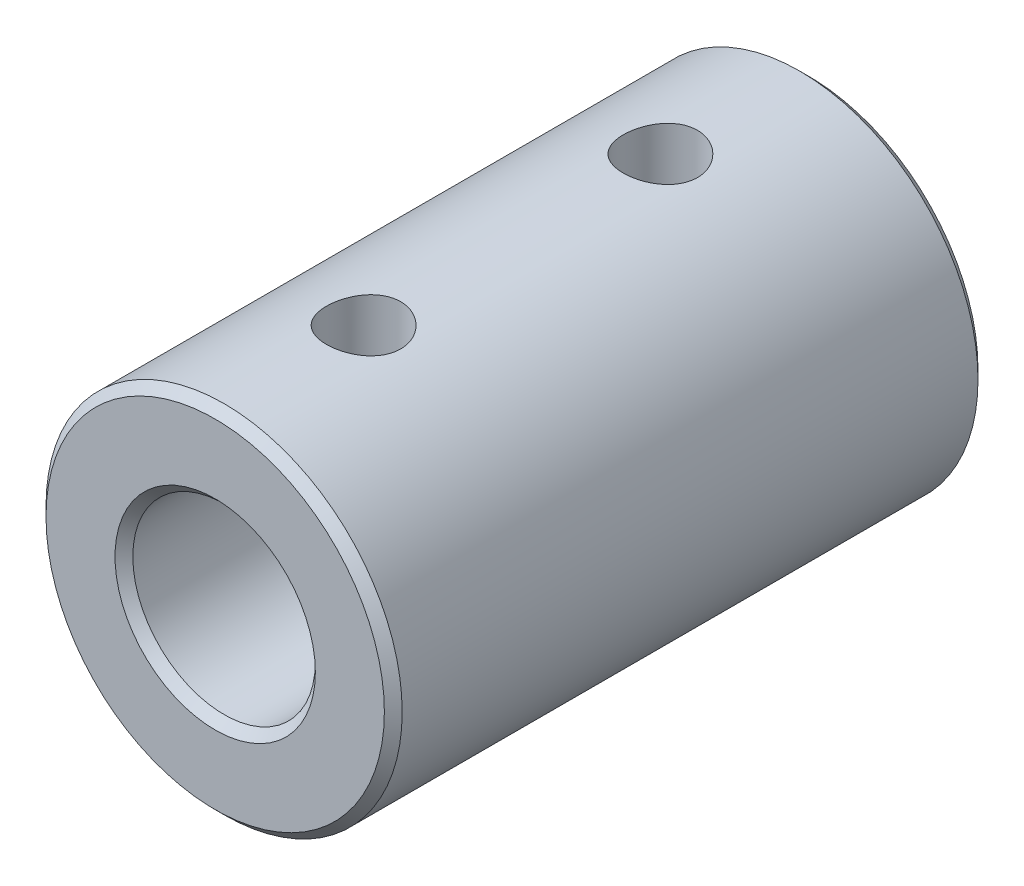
from build123d import *

# Parameters (mm, degrees)
ESQUISSE1_R             = 6
ESQUISSE1_R_2           = 2.575
BOSS_EXTRU_1_DEPTH      = 10
ESQUISSE2_R             = 3.075
ENL_V_MAT_EXTRU_1_DEPTH = 10
ESQUISSE3_R             = 1.25
ENL_V_MAT_EXTRU_2_DEPTH = 6
CHANFREIN1_SIZE         = 0.3


with BuildPart() as part:
    # Esquisse1 → Boss.-Extru.1 (new, symmetric)
    with BuildSketch(Plane.XY):
        Circle(ESQUISSE1_R)
        Circle(ESQUISSE1_R_2, mode=Mode.SUBTRACT)
    extrude(amount=BOSS_EXTRU_1_DEPTH, both=True)

    # Esquisse2 → Enl_v. mat.-Extru.1 (cut)
    with BuildSketch(Plane.XY.offset(10)):
        Circle(ESQUISSE2_R)
    extrude(amount=-ENL_V_MAT_EXTRU_1_DEPTH, mode=Mode.SUBTRACT)

    # Esquisse3 → Enl_v. mat.-Extru.2 (cut, symmetric)
    with BuildSketch(Plane(origin=(0, 0, 0), x_dir=(-1, 0, 0), z_dir=(0, 1, 0))):
        with Locations(Location((0, 5, 0), (0, 0, 90))):
            Circle(ESQUISSE3_R)
        with Locations(Location((0, -5, 0), (0, 0, 90))):
            Circle(ESQUISSE3_R)
    extrude(amount=ENL_V_MAT_EXTRU_2_DEPTH, both=True, mode=Mode.SUBTRACT)

    # Chanfrein1
    chanfrein1_edges = [part.edges().sort_by_distance(p)[0] for p in [
        (-3.075, 0, 10),
        (-6, 0, -10),
        (-6, 0, 10),
        (-2.575, 0, -10),
    ]]
    chamfer(chanfrein1_edges, length=CHANFREIN1_SIZE)


solid = part.part
